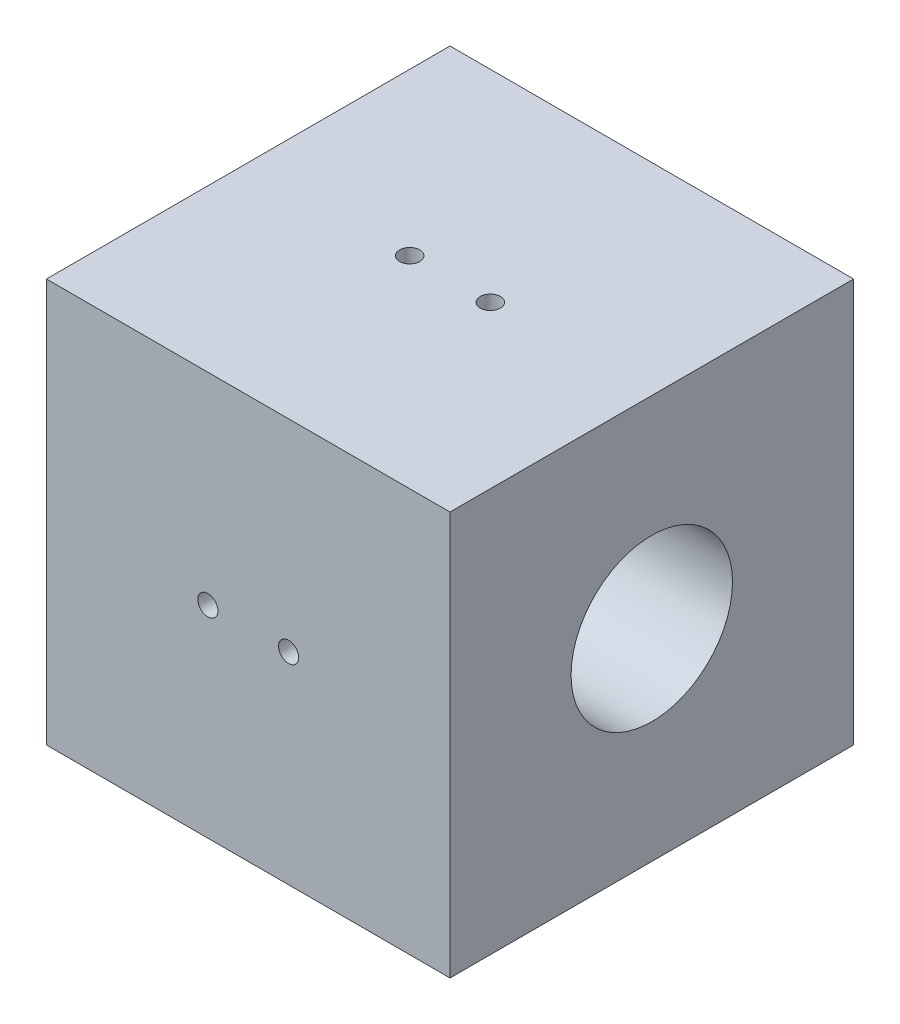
ISO-10303-21;
HEADER;
FILE_DESCRIPTION(('STEP AP214'),'2;1');
FILE_NAME('part.step','',(''),(''),'','','');
FILE_SCHEMA(('AUTOMOTIVE_DESIGN { 1 0 10303 214 1 1 1 1 }'));
ENDSEC;
DATA;
#1=APPLICATION_CONTEXT('core data for automotive mechanical design processes');
#2=APPLICATION_PROTOCOL_DEFINITION('international standard','automotive_design',2000,#1);
#3=PRODUCT_CONTEXT('',#1,'mechanical');
#4=PRODUCT('Part','Part','',(#3));
#5=PRODUCT_RELATED_PRODUCT_CATEGORY('part','',(#4));
#6=PRODUCT_DEFINITION_FORMATION('','',#4);
#7=PRODUCT_DEFINITION_CONTEXT('part definition',#1,'design');
#8=PRODUCT_DEFINITION('design','',#6,#7);
#9=PRODUCT_DEFINITION_SHAPE('','',#8);
#10=(LENGTH_UNIT() NAMED_UNIT(*) SI_UNIT(.MILLI.,.METRE.));
#11=(NAMED_UNIT(*) PLANE_ANGLE_UNIT() SI_UNIT($,.RADIAN.));
#12=(NAMED_UNIT(*) SI_UNIT($,.STERADIAN.) SOLID_ANGLE_UNIT());
#13=UNCERTAINTY_MEASURE_WITH_UNIT(LENGTH_MEASURE(1.E-05),#10,'distance_accuracy_value','');
#14=(GEOMETRIC_REPRESENTATION_CONTEXT(3) GLOBAL_UNCERTAINTY_ASSIGNED_CONTEXT((#13)) GLOBAL_UNIT_ASSIGNED_CONTEXT((#10,
#11,#12)) REPRESENTATION_CONTEXT('',''));
#15=CARTESIAN_POINT('',(0.,0.,0.));
#16=DIRECTION('',(0.,0.,1.));
#17=DIRECTION('',(1.,0.,0.));
#18=AXIS2_PLACEMENT_3D('',#15,#16,#17);
#19=CARTESIAN_POINT('',(63.5,-63.5,127.));
#20=DIRECTION('',(-1.,0.,0.));
#21=DIRECTION('',(0.,0.,1.));
#22=AXIS2_PLACEMENT_3D('',#19,#20,#21);
#23=PLANE('',#22);
#24=CARTESIAN_POINT('',(63.5,0.,63.5));
#25=DIRECTION('',(-1.,0.,0.));
#26=DIRECTION('',(0.,0.,1.));
#27=AXIS2_PLACEMENT_3D('',#24,#25,#26);
#28=CIRCLE('',#27,25.4);
#29=CARTESIAN_POINT('',(63.5,0.,88.9));
#30=VERTEX_POINT('',#29);
#31=EDGE_CURVE('E163',#30,#30,#28,.T.);
#32=ORIENTED_EDGE('',*,*,#31,.T.);
#33=EDGE_LOOP('',(#32));
#34=FACE_BOUND('',#33,.T.);
#35=DIRECTION('',(0.,1.,0.));
#36=VECTOR('',#35,1.);
#37=CARTESIAN_POINT('',(63.5,-63.5,0.));
#38=LINE('',#37,#36);
#39=CARTESIAN_POINT('',(63.5,-63.5,0.));
#40=VERTEX_POINT('',#39);
#41=CARTESIAN_POINT('',(63.5,63.5,0.));
#42=VERTEX_POINT('',#41);
#43=EDGE_CURVE('E116',#40,#42,#38,.T.);
#44=ORIENTED_EDGE('',*,*,#43,.T.);
#45=DIRECTION('',(0.,0.,-1.));
#46=VECTOR('',#45,1.);
#47=CARTESIAN_POINT('',(63.5,63.5,127.));
#48=LINE('',#47,#46);
#49=CARTESIAN_POINT('',(63.5,63.5,127.));
#50=VERTEX_POINT('',#49);
#51=EDGE_CURVE('E13',#50,#42,#48,.T.);
#52=ORIENTED_EDGE('',*,*,#51,.F.);
#53=DIRECTION('',(0.,1.,0.));
#54=VECTOR('',#53,1.);
#55=CARTESIAN_POINT('',(63.5,-63.5,127.));
#56=LINE('',#55,#54);
#57=CARTESIAN_POINT('',(63.5,-63.5,127.));
#58=VERTEX_POINT('',#57);
#59=EDGE_CURVE('E103',#58,#50,#56,.T.);
#60=ORIENTED_EDGE('',*,*,#59,.F.);
#61=DIRECTION('',(0.,0.,-1.));
#62=VECTOR('',#61,1.);
#63=CARTESIAN_POINT('',(63.5,-63.5,127.));
#64=LINE('',#63,#62);
#65=EDGE_CURVE('E112',#58,#40,#64,.T.);
#66=ORIENTED_EDGE('',*,*,#65,.T.);
#67=EDGE_LOOP('',(#44,#52,#60,#66));
#68=FACE_BOUND('',#67,.T.);
#69=ADVANCED_FACE('F46',(#34,#68),#23,.F.);
#70=CARTESIAN_POINT('',(-63.5,63.5,127.));
#71=DIRECTION('',(0.,-1.,0.));
#72=DIRECTION('',(0.,0.,-1.));
#73=AXIS2_PLACEMENT_3D('',#70,#71,#72);
#74=PLANE('',#73);
#75=CARTESIAN_POINT('',(-12.7,63.5,63.5));
#76=DIRECTION('',(0.,-1.,0.));
#77=DIRECTION('',(0.,0.,-1.));
#78=AXIS2_PLACEMENT_3D('',#75,#76,#77);
#79=CIRCLE('',#78,3.175);
#80=CARTESIAN_POINT('',(-12.7,63.5,60.325));
#81=VERTEX_POINT('',#80);
#82=EDGE_CURVE('E119',#81,#81,#79,.T.);
#83=ORIENTED_EDGE('',*,*,#82,.T.);
#84=EDGE_LOOP('',(#83));
#85=FACE_BOUND('',#84,.T.);
#86=CARTESIAN_POINT('',(12.7,63.5,63.5));
#87=DIRECTION('',(0.,-1.,0.));
#88=DIRECTION('',(0.,0.,-1.));
#89=AXIS2_PLACEMENT_3D('',#86,#87,#88);
#90=CIRCLE('',#89,3.175);
#91=CARTESIAN_POINT('',(12.7,63.5,60.325));
#92=VERTEX_POINT('',#91);
#93=EDGE_CURVE('E125',#92,#92,#90,.T.);
#94=ORIENTED_EDGE('',*,*,#93,.T.);
#95=EDGE_LOOP('',(#94));
#96=FACE_BOUND('',#95,.T.);
#97=DIRECTION('',(-1.,0.,0.));
#98=VECTOR('',#97,1.);
#99=CARTESIAN_POINT('',(-63.5,63.5,0.));
#100=LINE('',#99,#98);
#101=CARTESIAN_POINT('',(-63.5,63.5,0.));
#102=VERTEX_POINT('',#101);
#103=EDGE_CURVE('E107',#42,#102,#100,.T.);
#104=ORIENTED_EDGE('',*,*,#103,.T.);
#105=DIRECTION('',(0.,0.,-1.));
#106=VECTOR('',#105,1.);
#107=CARTESIAN_POINT('',(-63.5,63.5,127.));
#108=LINE('',#107,#106);
#109=CARTESIAN_POINT('',(-63.5,63.5,127.));
#110=VERTEX_POINT('',#109);
#111=EDGE_CURVE('E59',#110,#102,#108,.T.);
#112=ORIENTED_EDGE('',*,*,#111,.F.);
#113=DIRECTION('',(-1.,0.,0.));
#114=VECTOR('',#113,1.);
#115=CARTESIAN_POINT('',(-63.5,63.5,127.));
#116=LINE('',#115,#114);
#117=EDGE_CURVE('E98',#50,#110,#116,.T.);
#118=ORIENTED_EDGE('',*,*,#117,.F.);
#119=ORIENTED_EDGE('',*,*,#51,.T.);
#120=EDGE_LOOP('',(#104,#112,#118,#119));
#121=FACE_BOUND('',#120,.T.);
#122=ADVANCED_FACE('F106',(#85,#96,#121),#74,.F.);
#123=CARTESIAN_POINT('',(-63.5,-63.5,127.));
#124=DIRECTION('',(1.,0.,0.));
#125=DIRECTION('',(0.,0.,-1.));
#126=AXIS2_PLACEMENT_3D('',#123,#124,#125);
#127=PLANE('',#126);
#128=CARTESIAN_POINT('',(-63.5,0.,63.5));
#129=DIRECTION('',(-1.,0.,0.));
#130=DIRECTION('',(0.,0.,1.));
#131=AXIS2_PLACEMENT_3D('',#128,#129,#130);
#132=CIRCLE('',#131,25.4);
#133=CARTESIAN_POINT('',(-63.5,0.,88.9));
#134=VERTEX_POINT('',#133);
#135=EDGE_CURVE('E187',#134,#134,#132,.T.);
#136=ORIENTED_EDGE('',*,*,#135,.F.);
#137=EDGE_LOOP('',(#136));
#138=FACE_BOUND('',#137,.T.);
#139=DIRECTION('',(0.,-1.,0.));
#140=VECTOR('',#139,1.);
#141=CARTESIAN_POINT('',(-63.5,-63.5,0.));
#142=LINE('',#141,#140);
#143=CARTESIAN_POINT('',(-63.5,-63.5,0.));
#144=VERTEX_POINT('',#143);
#145=EDGE_CURVE('E85',#102,#144,#142,.T.);
#146=ORIENTED_EDGE('',*,*,#145,.T.);
#147=DIRECTION('',(0.,0.,-1.));
#148=VECTOR('',#147,1.);
#149=CARTESIAN_POINT('',(-63.5,-63.5,127.));
#150=LINE('',#149,#148);
#151=CARTESIAN_POINT('',(-63.5,-63.5,127.));
#152=VERTEX_POINT('',#151);
#153=EDGE_CURVE('E108',#152,#144,#150,.T.);
#154=ORIENTED_EDGE('',*,*,#153,.F.);
#155=DIRECTION('',(0.,-1.,0.));
#156=VECTOR('',#155,1.);
#157=CARTESIAN_POINT('',(-63.5,-63.5,127.));
#158=LINE('',#157,#156);
#159=EDGE_CURVE('E101',#110,#152,#158,.T.);
#160=ORIENTED_EDGE('',*,*,#159,.F.);
#161=ORIENTED_EDGE('',*,*,#111,.T.);
#162=EDGE_LOOP('',(#146,#154,#160,#161));
#163=FACE_BOUND('',#162,.T.);
#164=ADVANCED_FACE('F110',(#138,#163),#127,.F.);
#165=CARTESIAN_POINT('',(-63.5,-63.5,127.));
#166=DIRECTION('',(0.,1.,0.));
#167=DIRECTION('',(0.,0.,1.));
#168=AXIS2_PLACEMENT_3D('',#165,#166,#167);
#169=PLANE('',#168);
#170=DIRECTION('',(1.,0.,0.));
#171=VECTOR('',#170,1.);
#172=CARTESIAN_POINT('',(-63.5,-63.5,0.));
#173=LINE('',#172,#171);
#174=EDGE_CURVE('E91',#144,#40,#173,.T.);
#175=ORIENTED_EDGE('',*,*,#174,.T.);
#176=ORIENTED_EDGE('',*,*,#65,.F.);
#177=DIRECTION('',(1.,0.,0.));
#178=VECTOR('',#177,1.);
#179=CARTESIAN_POINT('',(-63.5,-63.5,127.));
#180=LINE('',#179,#178);
#181=EDGE_CURVE('E68',#152,#58,#180,.T.);
#182=ORIENTED_EDGE('',*,*,#181,.F.);
#183=ORIENTED_EDGE('',*,*,#153,.T.);
#184=EDGE_LOOP('',(#175,#176,#182,#183));
#185=FACE_BOUND('',#184,.T.);
#186=ADVANCED_FACE('F176',(#185),#169,.F.);
#187=CARTESIAN_POINT('',(0.,0.,127.));
#188=DIRECTION('',(0.,0.,-1.));
#189=DIRECTION('',(-1.,0.,0.));
#190=AXIS2_PLACEMENT_3D('',#187,#188,#189);
#191=PLANE('',#190);
#192=CARTESIAN_POINT('',(-12.7,0.,127.));
#193=DIRECTION('',(0.,0.,-1.));
#194=DIRECTION('',(-1.,0.,0.));
#195=AXIS2_PLACEMENT_3D('',#192,#193,#194);
#196=CIRCLE('',#195,3.175);
#197=CARTESIAN_POINT('',(-15.875,0.,127.));
#198=VERTEX_POINT('',#197);
#199=EDGE_CURVE('E128',#198,#198,#196,.T.);
#200=ORIENTED_EDGE('',*,*,#199,.T.);
#201=EDGE_LOOP('',(#200));
#202=FACE_BOUND('',#201,.T.);
#203=CARTESIAN_POINT('',(12.7,0.,127.));
#204=DIRECTION('',(0.,0.,-1.));
#205=DIRECTION('',(-1.,0.,0.));
#206=AXIS2_PLACEMENT_3D('',#203,#204,#205);
#207=CIRCLE('',#206,3.175);
#208=CARTESIAN_POINT('',(9.525,0.,127.));
#209=VERTEX_POINT('',#208);
#210=EDGE_CURVE('E131',#209,#209,#207,.T.);
#211=ORIENTED_EDGE('',*,*,#210,.T.);
#212=EDGE_LOOP('',(#211));
#213=FACE_BOUND('',#212,.T.);
#214=ORIENTED_EDGE('',*,*,#59,.T.);
#215=ORIENTED_EDGE('',*,*,#117,.T.);
#216=ORIENTED_EDGE('',*,*,#159,.T.);
#217=ORIENTED_EDGE('',*,*,#181,.T.);
#218=EDGE_LOOP('',(#214,#215,#216,#217));
#219=FACE_BOUND('',#218,.T.);
#220=ADVANCED_FACE('F99',(#202,#213,#219),#191,.F.);
#221=CARTESIAN_POINT('',(0.,0.,0.));
#222=DIRECTION('',(0.,0.,-1.));
#223=DIRECTION('',(-1.,0.,0.));
#224=AXIS2_PLACEMENT_3D('',#221,#222,#223);
#225=PLANE('',#224);
#226=ORIENTED_EDGE('',*,*,#43,.F.);
#227=ORIENTED_EDGE('',*,*,#174,.F.);
#228=ORIENTED_EDGE('',*,*,#145,.F.);
#229=ORIENTED_EDGE('',*,*,#103,.F.);
#230=EDGE_LOOP('',(#226,#227,#228,#229));
#231=FACE_BOUND('',#230,.T.);
#232=ADVANCED_FACE('F166',(#231),#225,.T.);
#233=CARTESIAN_POINT('',(12.7,15.5,63.5));
#234=DIRECTION('',(0.,1.,0.));
#235=DIRECTION('',(0.,0.,1.));
#236=AXIS2_PLACEMENT_3D('',#233,#234,#235);
#237=CYLINDRICAL_SURFACE('',#236,3.175);
#238=CARTESIAN_POINT('',(12.7,25.2007812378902,66.675));
#239=CARTESIAN_POINT('',(12.5224079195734,25.2007837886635,66.6749924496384));
#240=CARTESIAN_POINT('',(12.3447048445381,25.2026787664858,66.6600494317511));
#241=CARTESIAN_POINT('',(11.9942442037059,25.2100510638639,66.6006750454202));
#242=CARTESIAN_POINT('',(11.8214920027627,25.2155321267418,66.5562128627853));
#243=CARTESIAN_POINT('',(11.4860579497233,25.2294462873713,66.4391313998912));
#244=CARTESIAN_POINT('',(11.3233693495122,25.2378773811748,66.3665312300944));
#245=CARTESIAN_POINT('',(11.0125148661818,25.2567392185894,66.1952755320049));
#246=CARTESIAN_POINT('',(10.8643465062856,25.2671696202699,66.0966244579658));
#247=CARTESIAN_POINT('',(10.5858789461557,25.2889202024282,65.875475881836));
#248=CARTESIAN_POINT('',(10.4556727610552,25.3002445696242,65.7528616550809));
#249=CARTESIAN_POINT('',(10.2176290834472,25.3224694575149,65.4875185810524));
#250=CARTESIAN_POINT('',(10.1097927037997,25.333369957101,65.3447887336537));
#251=CARTESIAN_POINT('',(9.91921615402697,25.3535617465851,65.0426814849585));
#252=CARTESIAN_POINT('',(9.83656015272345,25.362847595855,64.8832505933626));
#253=CARTESIAN_POINT('',(9.69922977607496,25.3787178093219,64.552635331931));
#254=CARTESIAN_POINT('',(9.64455436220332,25.3853022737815,64.3814513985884));
#255=CARTESIAN_POINT('',(9.56501507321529,25.3949983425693,64.0331405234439));
#256=CARTESIAN_POINT('',(9.53999656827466,25.3981279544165,63.8560494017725));
#257=CARTESIAN_POINT('',(9.5200020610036,25.400623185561,63.5001564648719));
#258=CARTESIAN_POINT('',(9.52502487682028,25.3999889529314,63.3213547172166));
#259=CARTESIAN_POINT('',(9.56484650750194,25.3950425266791,62.9681681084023));
#260=CARTESIAN_POINT('',(9.59947902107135,25.3907508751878,62.7937641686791));
#261=CARTESIAN_POINT('',(9.69727699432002,25.3789949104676,62.4532632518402));
#262=CARTESIAN_POINT('',(9.76044299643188,25.3715305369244,62.2871664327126));
#263=CARTESIAN_POINT('',(9.91369174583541,25.3542324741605,61.9674798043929));
#264=CARTESIAN_POINT('',(10.0038464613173,25.3443924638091,61.8139248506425));
#265=CARTESIAN_POINT('',(10.2084611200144,25.3234440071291,61.5240610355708));
#266=CARTESIAN_POINT('',(10.3229221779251,25.3123355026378,61.387752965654));
#267=CARTESIAN_POINT('',(10.57383180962,25.2900036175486,61.1352752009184));
#268=CARTESIAN_POINT('',(10.7104253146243,25.27877997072,61.0192495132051));
#269=CARTESIAN_POINT('',(11.0012245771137,25.2575577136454,60.8117492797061));
#270=CARTESIAN_POINT('',(11.1554303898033,25.2475591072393,60.7202748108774));
#271=CARTESIAN_POINT('',(11.4772052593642,25.2299190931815,60.5644653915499));
#272=CARTESIAN_POINT('',(11.6447799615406,25.2222786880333,60.5001419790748));
#273=CARTESIAN_POINT('',(11.9884691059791,25.2102396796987,60.4005882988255));
#274=CARTESIAN_POINT('',(12.1645831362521,25.2058409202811,60.3653566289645));
#275=CARTESIAN_POINT('',(12.5190798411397,25.2008117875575,60.3251772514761));
#276=CARTESIAN_POINT('',(12.6974392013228,25.2001561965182,60.3200268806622));
#277=CARTESIAN_POINT('',(13.0524782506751,25.2026209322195,60.3396215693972));
#278=CARTESIAN_POINT('',(13.2291579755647,25.2057411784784,60.3643659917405));
#279=CARTESIAN_POINT('',(13.5752151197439,25.2153830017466,60.4428772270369));
#280=CARTESIAN_POINT('',(13.7446151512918,25.2218930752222,60.4965459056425));
#281=CARTESIAN_POINT('',(14.0720116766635,25.2375716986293,60.6312811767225));
#282=CARTESIAN_POINT('',(14.2300077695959,25.2467403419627,60.7123487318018));
#283=CARTESIAN_POINT('',(14.5310283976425,25.2667634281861,60.9000788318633));
#284=CARTESIAN_POINT('',(14.6739694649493,25.2776265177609,61.0068742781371));
#285=CARTESIAN_POINT('',(14.9399708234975,25.299787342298,61.2428407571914));
#286=CARTESIAN_POINT('',(15.0630303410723,25.3110850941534,61.3720126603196));
#287=CARTESIAN_POINT('',(15.2864873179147,25.3329197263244,61.6499506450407));
#288=CARTESIAN_POINT('',(15.3867516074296,25.343451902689,61.7988242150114));
#289=CARTESIAN_POINT('',(15.5608505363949,25.3624983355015,62.1114168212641));
#290=CARTESIAN_POINT('',(15.6346857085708,25.371012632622,62.2751355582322));
#291=CARTESIAN_POINT('',(15.7536105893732,25.3850430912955,62.6123285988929));
#292=CARTESIAN_POINT('',(15.7987772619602,25.3905672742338,62.7857754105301));
#293=CARTESIAN_POINT('',(15.859333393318,25.3980283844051,63.137864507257));
#294=CARTESIAN_POINT('',(15.874724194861,25.3999654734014,63.3165065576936));
#295=CARTESIAN_POINT('',(15.875266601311,25.4000333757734,63.6726148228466));
#296=CARTESIAN_POINT('',(15.8606235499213,25.3981900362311,63.8500807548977));
#297=CARTESIAN_POINT('',(15.8019488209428,25.3909555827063,64.2000084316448));
#298=CARTESIAN_POINT('',(15.757917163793,25.3855644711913,64.3724701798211));
#299=CARTESIAN_POINT('',(15.641779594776,25.371837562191,64.7074670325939));
#300=CARTESIAN_POINT('',(15.5696835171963,25.363502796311,64.8700055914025));
#301=CARTESIAN_POINT('',(15.3994849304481,25.3448114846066,65.180709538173));
#302=CARTESIAN_POINT('',(15.3013821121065,25.3344549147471,65.3288747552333));
#303=CARTESIAN_POINT('',(15.0811951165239,25.3127915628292,65.6076751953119));
#304=CARTESIAN_POINT('',(14.9589581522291,25.3014790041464,65.7381893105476));
#305=CARTESIAN_POINT('',(14.6942899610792,25.2792250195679,65.9769332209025));
#306=CARTESIAN_POINT('',(14.551853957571,25.2682836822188,66.085157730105));
#307=CARTESIAN_POINT('',(14.2502001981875,25.2479659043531,66.2766076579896));
#308=CARTESIAN_POINT('',(14.0909197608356,25.2385956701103,66.3597349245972));
#309=CARTESIAN_POINT('',(13.7606319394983,25.2225537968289,66.4979433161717));
#310=CARTESIAN_POINT('',(13.5896375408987,25.2158792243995,66.5530549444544));
#311=CARTESIAN_POINT('',(13.2981319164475,25.2076049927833,66.6204736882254));
#312=CARTESIAN_POINT('',(13.1794593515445,25.2050588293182,66.6408916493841));
#313=CARTESIAN_POINT('',(12.9405414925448,25.20164609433,66.6681573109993));
#314=CARTESIAN_POINT('',(12.8202962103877,25.2007795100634,66.6750051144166));
#315=CARTESIAN_POINT('',(12.7,25.2007812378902,66.675));
#316=B_SPLINE_CURVE_WITH_KNOTS('',3,(#238,#239,#240,#241,#242,#243,#244,#245,#246,#247,#248,
#249,#250,#251,#252,#253,#254,#255,#256,#257,#258,#259,#260,#261,#262,#263,#264,#265,#266,#267,
#268,#269,#270,#271,#272,#273,#274,#275,#276,#277,#278,#279,#280,#281,#282,#283,#284,#285,#286,
#287,#288,#289,#290,#291,#292,#293,#294,#295,#296,#297,#298,#299,#300,#301,#302,#303,#304,#305,
#306,#307,#308,#309,#310,#311,#312,#313,#314,#315),.UNSPECIFIED.,.T.,.F.,(4,2,2,2,2,2,2,2,2,2,2,
2,2,2,2,2,2,2,2,2,2,2,2,2,2,2,2,2,2,2,2,2,2,2,2,2,2,2,4),(0.,0.532336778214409,1.06523012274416,
1.59776217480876,2.13020323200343,2.66530553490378,3.20043445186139,3.73733296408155,
4.27421154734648,4.80827838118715,5.34232420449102,5.87339014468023,6.40446618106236,
6.93697119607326,7.46950063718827,8.00566975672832,8.54184055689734,9.07823897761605,
9.61461154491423,10.1473662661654,10.680109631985,11.2110567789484,11.7420225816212,
12.2757923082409,12.8095828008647,13.3464158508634,13.8832380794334,14.4186129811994,
14.9539637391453,15.4856664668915,16.0173688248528,16.5488850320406,17.0804075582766,
17.6154096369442,18.1505384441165,18.6877337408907,19.2243428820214,19.5849365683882,
19.9455275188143),.UNSPECIFIED.);
#317=CARTESIAN_POINT('',(12.7,25.2007812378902,66.675));
#318=VERTEX_POINT('',#317);
#319=EDGE_CURVE('E133',#318,#318,#316,.T.);
#320=ORIENTED_EDGE('',*,*,#319,.T.);
#321=EDGE_LOOP('',(#320));
#322=FACE_BOUND('',#321,.T.);
#323=ORIENTED_EDGE('',*,*,#93,.F.);
#324=EDGE_LOOP('',(#323));
#325=FACE_BOUND('',#324,.T.);
#326=ADVANCED_FACE('F168',(#322,#325),#237,.F.);
#327=CARTESIAN_POINT('',(-12.7,15.5,63.5));
#328=DIRECTION('',(0.,1.,0.));
#329=DIRECTION('',(0.,0.,1.));
#330=AXIS2_PLACEMENT_3D('',#327,#328,#329);
#331=CYLINDRICAL_SURFACE('',#330,3.175);
#332=CARTESIAN_POINT('',(-12.7,25.2007812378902,66.675));
#333=CARTESIAN_POINT('',(-12.8775920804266,25.2007837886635,66.6749924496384));
#334=CARTESIAN_POINT('',(-13.0552951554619,25.2026787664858,66.6600494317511));
#335=CARTESIAN_POINT('',(-13.4057557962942,25.2100510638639,66.6006750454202));
#336=CARTESIAN_POINT('',(-13.5785079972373,25.2155321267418,66.5562128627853));
#337=CARTESIAN_POINT('',(-13.9139420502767,25.2294462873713,66.4391313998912));
#338=CARTESIAN_POINT('',(-14.0766306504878,25.2378773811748,66.3665312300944));
#339=CARTESIAN_POINT('',(-14.3874851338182,25.2567392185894,66.1952755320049));
#340=CARTESIAN_POINT('',(-14.5356534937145,25.2671696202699,66.0966244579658));
#341=CARTESIAN_POINT('',(-14.8141210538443,25.2889202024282,65.875475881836));
#342=CARTESIAN_POINT('',(-14.9443272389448,25.3002445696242,65.7528616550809));
#343=CARTESIAN_POINT('',(-15.1823709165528,25.3224694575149,65.4875185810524));
#344=CARTESIAN_POINT('',(-15.2902072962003,25.333369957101,65.3447887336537));
#345=CARTESIAN_POINT('',(-15.480783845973,25.3535617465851,65.0426814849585));
#346=CARTESIAN_POINT('',(-15.5634398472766,25.362847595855,64.8832505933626));
#347=CARTESIAN_POINT('',(-15.700770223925,25.3787178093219,64.552635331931));
#348=CARTESIAN_POINT('',(-15.7554456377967,25.3853022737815,64.3814513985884));
#349=CARTESIAN_POINT('',(-15.8349849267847,25.3949983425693,64.0331405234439));
#350=CARTESIAN_POINT('',(-15.8600034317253,25.3981279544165,63.8560494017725));
#351=CARTESIAN_POINT('',(-15.8799979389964,25.400623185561,63.5001564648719));
#352=CARTESIAN_POINT('',(-15.8749751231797,25.3999889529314,63.3213547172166));
#353=CARTESIAN_POINT('',(-15.8351534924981,25.3950425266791,62.9681681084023));
#354=CARTESIAN_POINT('',(-15.8005209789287,25.3907508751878,62.7937641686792));
#355=CARTESIAN_POINT('',(-15.70272300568,25.3789949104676,62.4532632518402));
#356=CARTESIAN_POINT('',(-15.6395570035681,25.3715305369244,62.2871664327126));
#357=CARTESIAN_POINT('',(-15.4863082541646,25.3542324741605,61.9674798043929));
#358=CARTESIAN_POINT('',(-15.3961535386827,25.3443924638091,61.8139248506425));
#359=CARTESIAN_POINT('',(-15.1915388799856,25.3234440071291,61.5240610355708));
#360=CARTESIAN_POINT('',(-15.0770778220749,25.3123355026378,61.387752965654));
#361=CARTESIAN_POINT('',(-14.8261681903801,25.2900036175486,61.1352752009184));
#362=CARTESIAN_POINT('',(-14.6895746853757,25.27877997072,61.0192495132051));
#363=CARTESIAN_POINT('',(-14.3987754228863,25.2575577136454,60.8117492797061));
#364=CARTESIAN_POINT('',(-14.2445696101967,25.2475591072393,60.7202748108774));
#365=CARTESIAN_POINT('',(-13.9227947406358,25.2299190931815,60.5644653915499));
#366=CARTESIAN_POINT('',(-13.7552200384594,25.2222786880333,60.5001419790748));
#367=CARTESIAN_POINT('',(-13.4115308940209,25.2102396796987,60.4005882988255));
#368=CARTESIAN_POINT('',(-13.2354168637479,25.2058409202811,60.3653566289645));
#369=CARTESIAN_POINT('',(-12.8809201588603,25.2008117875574,60.3251772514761));
#370=CARTESIAN_POINT('',(-12.7025607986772,25.2001561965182,60.3200268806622));
#371=CARTESIAN_POINT('',(-12.3475217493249,25.2026209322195,60.3396215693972));
#372=CARTESIAN_POINT('',(-12.1708420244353,25.2057411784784,60.3643659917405));
#373=CARTESIAN_POINT('',(-11.8247848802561,25.2153830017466,60.4428772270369));
#374=CARTESIAN_POINT('',(-11.6553848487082,25.2218930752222,60.4965459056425));
#375=CARTESIAN_POINT('',(-11.3279883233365,25.2375716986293,60.6312811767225));
#376=CARTESIAN_POINT('',(-11.1699922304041,25.2467403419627,60.7123487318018));
#377=CARTESIAN_POINT('',(-10.8689716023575,25.2667634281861,60.9000788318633));
#378=CARTESIAN_POINT('',(-10.7260305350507,25.277626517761,61.0068742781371));
#379=CARTESIAN_POINT('',(-10.4600291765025,25.299787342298,61.2428407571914));
#380=CARTESIAN_POINT('',(-10.3369696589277,25.3110850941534,61.3720126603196));
#381=CARTESIAN_POINT('',(-10.1135126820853,25.3329197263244,61.6499506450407));
#382=CARTESIAN_POINT('',(-10.0132483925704,25.343451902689,61.7988242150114));
#383=CARTESIAN_POINT('',(-9.83914946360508,25.3624983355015,62.1114168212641));
#384=CARTESIAN_POINT('',(-9.76531429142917,25.371012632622,62.2751355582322));
#385=CARTESIAN_POINT('',(-9.6463894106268,25.3850430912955,62.6123285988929));
#386=CARTESIAN_POINT('',(-9.60122273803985,25.3905672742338,62.78577541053));
#387=CARTESIAN_POINT('',(-9.54066660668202,25.3980283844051,63.137864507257));
#388=CARTESIAN_POINT('',(-9.52527580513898,25.3999654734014,63.3165065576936));
#389=CARTESIAN_POINT('',(-9.52473339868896,25.4000333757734,63.6726148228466));
#390=CARTESIAN_POINT('',(-9.53937645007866,25.3981900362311,63.8500807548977));
#391=CARTESIAN_POINT('',(-9.59805117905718,25.3909555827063,64.2000084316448));
#392=CARTESIAN_POINT('',(-9.64208283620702,25.3855644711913,64.3724701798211));
#393=CARTESIAN_POINT('',(-9.75822040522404,25.371837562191,64.7074670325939));
#394=CARTESIAN_POINT('',(-9.8303164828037,25.363502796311,64.8700055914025));
#395=CARTESIAN_POINT('',(-10.0005150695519,25.3448114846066,65.180709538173));
#396=CARTESIAN_POINT('',(-10.0986178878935,25.3344549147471,65.3288747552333));
#397=CARTESIAN_POINT('',(-10.3188048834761,25.3127915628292,65.6076751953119));
#398=CARTESIAN_POINT('',(-10.4410418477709,25.3014790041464,65.7381893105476));
#399=CARTESIAN_POINT('',(-10.7057100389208,25.2792250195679,65.9769332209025));
#400=CARTESIAN_POINT('',(-10.848146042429,25.2682836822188,66.085157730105));
#401=CARTESIAN_POINT('',(-11.1497998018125,25.2479659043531,66.2766076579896));
#402=CARTESIAN_POINT('',(-11.3090802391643,25.2385956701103,66.3597349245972));
#403=CARTESIAN_POINT('',(-11.6393680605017,25.2225537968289,66.4979433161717));
#404=CARTESIAN_POINT('',(-11.8103624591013,25.2158792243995,66.5530549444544));
#405=CARTESIAN_POINT('',(-12.1018680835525,25.2076049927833,66.6204736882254));
#406=CARTESIAN_POINT('',(-12.2205406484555,25.2050588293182,66.6408916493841));
#407=CARTESIAN_POINT('',(-12.4594585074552,25.20164609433,66.6681573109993));
#408=CARTESIAN_POINT('',(-12.5797037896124,25.2007795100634,66.6750051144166));
#409=CARTESIAN_POINT('',(-12.7,25.2007812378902,66.675));
#410=B_SPLINE_CURVE_WITH_KNOTS('',3,(#332,#333,#334,#335,#336,#337,#338,#339,#340,#341,#342,
#343,#344,#345,#346,#347,#348,#349,#350,#351,#352,#353,#354,#355,#356,#357,#358,#359,#360,#361,
#362,#363,#364,#365,#366,#367,#368,#369,#370,#371,#372,#373,#374,#375,#376,#377,#378,#379,#380,
#381,#382,#383,#384,#385,#386,#387,#388,#389,#390,#391,#392,#393,#394,#395,#396,#397,#398,#399,
#400,#401,#402,#403,#404,#405,#406,#407,#408,#409),.UNSPECIFIED.,.T.,.F.,(4,2,2,2,2,2,2,2,2,2,2,
2,2,2,2,2,2,2,2,2,2,2,2,2,2,2,2,2,2,2,2,2,2,2,2,2,2,2,4),(0.,0.532336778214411,1.06523012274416,
1.59776217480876,2.13020323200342,2.66530553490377,3.20043445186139,3.73733296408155,
4.27421154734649,4.80827838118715,5.34232420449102,5.87339014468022,6.40446618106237,
6.93697119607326,7.46950063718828,8.00566975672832,8.54184055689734,9.07823897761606,
9.61461154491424,10.1473662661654,10.680109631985,11.2110567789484,11.7420225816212,
12.2757923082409,12.8095828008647,13.3464158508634,13.8832380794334,14.4186129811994,
14.9539637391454,15.4856664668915,16.0173688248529,16.5488850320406,17.0804075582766,
17.6154096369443,18.1505384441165,18.6877337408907,19.2243428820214,19.5849365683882,
19.9455275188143),.UNSPECIFIED.);
#411=CARTESIAN_POINT('',(-12.7,25.2007812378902,66.675));
#412=VERTEX_POINT('',#411);
#413=EDGE_CURVE('E197',#412,#412,#410,.T.);
#414=ORIENTED_EDGE('',*,*,#413,.T.);
#415=EDGE_LOOP('',(#414));
#416=FACE_BOUND('',#415,.T.);
#417=ORIENTED_EDGE('',*,*,#82,.F.);
#418=EDGE_LOOP('',(#417));
#419=FACE_BOUND('',#418,.T.);
#420=ADVANCED_FACE('F149',(#416,#419),#331,.F.);
#421=CARTESIAN_POINT('',(12.7,0.,79.));
#422=DIRECTION('',(0.,0.,1.));
#423=DIRECTION('',(1.,0.,0.));
#424=AXIS2_PLACEMENT_3D('',#421,#422,#423);
#425=CYLINDRICAL_SURFACE('',#424,3.175);
#426=CARTESIAN_POINT('',(15.875,0.,88.9));
#427=CARTESIAN_POINT('',(15.8749924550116,-0.177598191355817,88.8999975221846));
#428=CARTESIAN_POINT('',(15.860048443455,-0.355307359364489,88.8981176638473));
#429=CARTESIAN_POINT('',(15.8006697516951,-0.705780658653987,88.8907993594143));
#430=CARTESIAN_POINT('',(15.7562042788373,-0.878539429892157,88.8853571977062));
#431=CARTESIAN_POINT('',(15.6391131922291,-1.21398738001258,88.871527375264));
#432=CARTESIAN_POINT('',(15.5665065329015,-1.3766832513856,88.8631416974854));
#433=CARTESIAN_POINT('',(15.3952355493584,-1.68754993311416,88.8443575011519));
#434=CARTESIAN_POINT('',(15.296575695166,-1.83572322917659,88.8339593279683));
#435=CARTESIAN_POINT('',(15.0754182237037,-2.11418527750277,88.8122470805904));
#436=CARTESIAN_POINT('',(14.9528058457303,-2.24438256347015,88.8009287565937));
#437=CARTESIAN_POINT('',(14.6874702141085,-2.48240904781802,88.7786861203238));
#438=CARTESIAN_POINT('',(14.5447459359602,-2.59023710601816,88.7677618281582));
#439=CARTESIAN_POINT('',(14.2426436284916,-2.7808049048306,88.7475022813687));
#440=CARTESIAN_POINT('',(14.0832111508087,-2.86345896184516,88.7381725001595));
#441=CARTESIAN_POINT('',(13.7525924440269,-3.0007853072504,88.7222143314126));
#442=CARTESIAN_POINT('',(13.5814066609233,-3.05545865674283,88.7155858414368));
#443=CARTESIAN_POINT('',(13.2330898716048,-3.13499370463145,88.7058213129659));
#444=CARTESIAN_POINT('',(13.0559946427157,-3.16000982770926,88.7026671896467));
#445=CARTESIAN_POINT('',(12.7000936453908,-3.17999814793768,88.7001531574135));
#446=CARTESIAN_POINT('',(12.5212879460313,-3.17497155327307,88.7007930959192));
#447=CARTESIAN_POINT('',(12.168117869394,-3.13514389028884,88.7057783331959));
#448=CARTESIAN_POINT('',(11.9937339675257,-3.10051292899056,88.7101024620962));
#449=CARTESIAN_POINT('',(11.6532723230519,-3.00272498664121,88.7219358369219));
#450=CARTESIAN_POINT('',(11.4871947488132,-2.93956742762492,88.7294451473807));
#451=CARTESIAN_POINT('',(11.1675316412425,-2.78633626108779,88.7468267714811));
#452=CARTESIAN_POINT('',(11.0139819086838,-2.6961887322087,88.7567055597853));
#453=CARTESIAN_POINT('',(10.7241254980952,-2.49158946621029,88.7777080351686));
#454=CARTESIAN_POINT('',(10.5878196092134,-2.37713661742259,88.7888317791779));
#455=CARTESIAN_POINT('',(10.3353327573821,-2.1262328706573,88.8111648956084));
#456=CARTESIAN_POINT('',(10.2192974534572,-1.98963534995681,88.8223743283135));
#457=CARTESIAN_POINT('',(10.0117797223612,-1.69882460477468,88.8435438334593));
#458=CARTESIAN_POINT('',(9.92029735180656,-1.54461133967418,88.8535039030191));
#459=CARTESIAN_POINT('',(9.76448222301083,-1.22283432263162,88.871058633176));
#460=CARTESIAN_POINT('',(9.70015858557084,-1.0552661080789,88.8786524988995));
#461=CARTESIAN_POINT('',(9.60060247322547,-0.71159108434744,88.8906119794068));
#462=CARTESIAN_POINT('',(9.56536863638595,-0.535484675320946,88.8949777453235));
#463=CARTESIAN_POINT('',(9.5251810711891,-0.180991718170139,88.8999694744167));
#464=CARTESIAN_POINT('',(9.52002668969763,-0.00262825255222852,88.9006202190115));
#465=CARTESIAN_POINT('',(9.53961482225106,0.352419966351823,88.898175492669));
#466=CARTESIAN_POINT('',(9.56435669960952,0.529104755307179,88.8950801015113));
#467=CARTESIAN_POINT('',(9.64286833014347,0.875188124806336,88.88550636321));
#468=CARTESIAN_POINT('',(9.69654240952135,1.04460874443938,88.8790391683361));
#469=CARTESIAN_POINT('',(9.83129536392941,1.37204406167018,88.8634458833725));
#470=CARTESIAN_POINT('',(9.91237516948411,1.53005837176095,88.8543197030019));
#471=CARTESIAN_POINT('',(10.1001234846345,1.83109174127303,88.8343641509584));
#472=CARTESIAN_POINT('',(10.2069217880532,1.97402927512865,88.8235262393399));
#473=CARTESIAN_POINT('',(10.4428918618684,2.24002217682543,88.8013863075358));
#474=CARTESIAN_POINT('',(10.5720645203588,2.36307675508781,88.7900842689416));
#475=CARTESIAN_POINT('',(10.8500004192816,2.58652258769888,88.7682134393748));
#476=CARTESIAN_POINT('',(10.9988709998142,2.68678083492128,88.7576491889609));
#477=CARTESIAN_POINT('',(11.3114559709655,2.86086916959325,88.7385247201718));
#478=CARTESIAN_POINT('',(11.4751700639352,2.93469978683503,88.729964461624));
#479=CARTESIAN_POINT('',(11.8123656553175,3.05362175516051,88.715848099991));
#480=CARTESIAN_POINT('',(11.9858203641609,3.09878809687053,88.7102841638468));
#481=CARTESIAN_POINT('',(12.3379261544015,3.15934089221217,88.7027679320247));
#482=CARTESIAN_POINT('',(12.5165769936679,3.17472873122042,88.7008154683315));
#483=CARTESIAN_POINT('',(12.8726805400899,3.17526230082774,88.7007481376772));
#484=CARTESIAN_POINT('',(13.0501329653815,3.16061699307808,88.7026067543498));
#485=CARTESIAN_POINT('',(13.4000330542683,3.10194249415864,88.7098951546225));
#486=CARTESIAN_POINT('',(13.5724807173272,3.05791329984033,88.7153249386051));
#487=CARTESIAN_POINT('',(13.9074486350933,2.94178618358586,88.7291356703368));
#488=CARTESIAN_POINT('',(14.0699724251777,2.86969832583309,88.7375155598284));
#489=CARTESIAN_POINT('',(14.3806502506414,2.69952076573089,88.7562840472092));
#490=CARTESIAN_POINT('',(14.5288041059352,2.60143073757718,88.7666726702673));
#491=CARTESIAN_POINT('',(14.8076046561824,2.38125804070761,88.7883746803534));
#492=CARTESIAN_POINT('',(14.9381279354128,2.2590196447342,88.7996937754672));
#493=CARTESIAN_POINT('',(15.1768896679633,1.99434478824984,88.8219309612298));
#494=CARTESIAN_POINT('',(15.2851228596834,1.85190357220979,88.8328489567));
#495=CARTESIAN_POINT('',(15.4765824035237,1.55024533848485,88.8530996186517));
#496=CARTESIAN_POINT('',(15.5597120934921,1.39096658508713,88.8624260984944));
#497=CARTESIAN_POINT('',(15.6979254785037,1.06068228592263,88.8783801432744));
#498=CARTESIAN_POINT('',(15.7530396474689,0.8896897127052,88.8850106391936));
#499=CARTESIAN_POINT('',(15.8204653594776,0.598177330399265,88.8932273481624));
#500=CARTESIAN_POINT('',(15.8408864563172,0.47949569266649,88.8957547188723));
#501=CARTESIAN_POINT('',(15.8681562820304,0.240559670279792,88.8991418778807));
#502=CARTESIAN_POINT('',(15.8750051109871,0.120305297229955,88.9000016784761));
#503=CARTESIAN_POINT('',(15.875,0.,88.9));
#504=B_SPLINE_CURVE_WITH_KNOTS('',3,(#426,#427,#428,#429,#430,#431,#432,#433,#434,#435,#436,
#437,#438,#439,#440,#441,#442,#443,#444,#445,#446,#447,#448,#449,#450,#451,#452,#453,#454,#455,
#456,#457,#458,#459,#460,#461,#462,#463,#464,#465,#466,#467,#468,#469,#470,#471,#472,#473,#474,
#475,#476,#477,#478,#479,#480,#481,#482,#483,#484,#485,#486,#487,#488,#489,#490,#491,#492,#493,
#494,#495,#496,#497,#498,#499,#500,#501,#502,#503),.UNSPECIFIED.,.T.,.F.,(4,2,2,2,2,2,2,2,2,2,2,
2,2,2,2,2,2,2,2,2,2,2,2,2,2,2,2,2,2,2,2,2,2,2,2,2,2,2,4),(0.,0.532355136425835,1.06526642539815,
1.59781939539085,2.13028105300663,2.6653593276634,3.20046486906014,3.73737187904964,
4.27425852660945,4.80833716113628,5.34239431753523,5.87340324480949,6.40442293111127,
6.93691051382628,7.46942245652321,8.00561617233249,8.54181112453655,9.07818600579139,
9.61453577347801,10.1473035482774,10.6800599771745,11.2110653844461,11.7420888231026,
12.275850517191,12.8096334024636,13.3464550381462,13.8832659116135,14.4186665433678,
14.9540422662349,15.4857056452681,16.0173690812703,16.5488419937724,17.0803215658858,
17.6153475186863,18.1504996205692,18.6876868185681,19.2242884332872,19.5849093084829,
19.9455275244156),.UNSPECIFIED.);
#505=CARTESIAN_POINT('',(15.875,0.,88.9));
#506=VERTEX_POINT('',#505);
#507=EDGE_CURVE('E192',#506,#506,#504,.T.);
#508=ORIENTED_EDGE('',*,*,#507,.T.);
#509=EDGE_LOOP('',(#508));
#510=FACE_BOUND('',#509,.T.);
#511=ORIENTED_EDGE('',*,*,#210,.F.);
#512=EDGE_LOOP('',(#511));
#513=FACE_BOUND('',#512,.T.);
#514=ADVANCED_FACE('F142',(#510,#513),#425,.F.);
#515=CARTESIAN_POINT('',(-12.7,0.,79.));
#516=DIRECTION('',(0.,0.,1.));
#517=DIRECTION('',(1.,0.,0.));
#518=AXIS2_PLACEMENT_3D('',#515,#516,#517);
#519=CYLINDRICAL_SURFACE('',#518,3.175);
#520=CARTESIAN_POINT('',(-9.525,0.,88.9));
#521=CARTESIAN_POINT('',(-9.52500754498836,-0.177598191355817,88.8999975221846));
#522=CARTESIAN_POINT('',(-9.53995155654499,-0.355307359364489,88.8981176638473));
#523=CARTESIAN_POINT('',(-9.59933024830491,-0.705780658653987,88.8907993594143));
#524=CARTESIAN_POINT('',(-9.64379572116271,-0.878539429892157,88.8853571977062));
#525=CARTESIAN_POINT('',(-9.76088680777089,-1.21398738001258,88.871527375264));
#526=CARTESIAN_POINT('',(-9.83349346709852,-1.3766832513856,88.8631416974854));
#527=CARTESIAN_POINT('',(-10.0047644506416,-1.68754993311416,88.8443575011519));
#528=CARTESIAN_POINT('',(-10.103424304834,-1.83572322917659,88.8339593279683));
#529=CARTESIAN_POINT('',(-10.3245817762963,-2.11418527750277,88.8122470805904));
#530=CARTESIAN_POINT('',(-10.4471941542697,-2.24438256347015,88.8009287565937));
#531=CARTESIAN_POINT('',(-10.7125297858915,-2.48240904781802,88.7786861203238));
#532=CARTESIAN_POINT('',(-10.8552540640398,-2.59023710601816,88.7677618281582));
#533=CARTESIAN_POINT('',(-11.1573563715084,-2.7808049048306,88.7475022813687));
#534=CARTESIAN_POINT('',(-11.3167888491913,-2.86345896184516,88.7381725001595));
#535=CARTESIAN_POINT('',(-11.6474075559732,-3.0007853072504,88.7222143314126));
#536=CARTESIAN_POINT('',(-11.8185933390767,-3.05545865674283,88.7155858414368));
#537=CARTESIAN_POINT('',(-12.1669101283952,-3.13499370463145,88.7058213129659));
#538=CARTESIAN_POINT('',(-12.3440053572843,-3.16000982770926,88.7026671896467));
#539=CARTESIAN_POINT('',(-12.6999063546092,-3.17999814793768,88.7001531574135));
#540=CARTESIAN_POINT('',(-12.8787120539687,-3.17497155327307,88.7007930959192));
#541=CARTESIAN_POINT('',(-13.231882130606,-3.13514389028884,88.7057783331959));
#542=CARTESIAN_POINT('',(-13.4062660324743,-3.10051292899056,88.7101024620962));
#543=CARTESIAN_POINT('',(-13.7467276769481,-3.0027249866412,88.7219358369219));
#544=CARTESIAN_POINT('',(-13.9128052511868,-2.93956742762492,88.7294451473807));
#545=CARTESIAN_POINT('',(-14.2324683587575,-2.78633626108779,88.7468267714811));
#546=CARTESIAN_POINT('',(-14.3860180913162,-2.6961887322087,88.7567055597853));
#547=CARTESIAN_POINT('',(-14.6758745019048,-2.49158946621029,88.7777080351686));
#548=CARTESIAN_POINT('',(-14.8121803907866,-2.37713661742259,88.7888317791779));
#549=CARTESIAN_POINT('',(-15.0646672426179,-2.1262328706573,88.8111648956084));
#550=CARTESIAN_POINT('',(-15.1807025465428,-1.98963534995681,88.8223743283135));
#551=CARTESIAN_POINT('',(-15.3882202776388,-1.69882460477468,88.8435438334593));
#552=CARTESIAN_POINT('',(-15.4797026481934,-1.54461133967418,88.8535039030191));
#553=CARTESIAN_POINT('',(-15.6355177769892,-1.22283432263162,88.871058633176));
#554=CARTESIAN_POINT('',(-15.6998414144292,-1.0552661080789,88.8786524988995));
#555=CARTESIAN_POINT('',(-15.7993975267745,-0.711591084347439,88.8906119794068));
#556=CARTESIAN_POINT('',(-15.8346313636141,-0.535484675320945,88.8949777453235));
#557=CARTESIAN_POINT('',(-15.8748189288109,-0.180991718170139,88.8999694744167));
#558=CARTESIAN_POINT('',(-15.8799733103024,-0.00262825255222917,88.9006202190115));
#559=CARTESIAN_POINT('',(-15.8603851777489,0.352419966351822,88.898175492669));
#560=CARTESIAN_POINT('',(-15.8356433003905,0.529104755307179,88.8950801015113));
#561=CARTESIAN_POINT('',(-15.7571316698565,0.875188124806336,88.88550636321));
#562=CARTESIAN_POINT('',(-15.7034575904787,1.04460874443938,88.8790391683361));
#563=CARTESIAN_POINT('',(-15.5687046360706,1.37204406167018,88.8634458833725));
#564=CARTESIAN_POINT('',(-15.4876248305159,1.53005837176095,88.8543197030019));
#565=CARTESIAN_POINT('',(-15.2998765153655,1.83109174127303,88.8343641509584));
#566=CARTESIAN_POINT('',(-15.1930782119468,1.97402927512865,88.8235262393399));
#567=CARTESIAN_POINT('',(-14.9571081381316,2.24002217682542,88.8013863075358));
#568=CARTESIAN_POINT('',(-14.8279354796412,2.36307675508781,88.7900842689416));
#569=CARTESIAN_POINT('',(-14.5499995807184,2.58652258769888,88.7682134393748));
#570=CARTESIAN_POINT('',(-14.4011290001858,2.68678083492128,88.7576491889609));
#571=CARTESIAN_POINT('',(-14.0885440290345,2.86086916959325,88.7385247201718));
#572=CARTESIAN_POINT('',(-13.9248299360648,2.93469978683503,88.729964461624));
#573=CARTESIAN_POINT('',(-13.5876343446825,3.05362175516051,88.715848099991));
#574=CARTESIAN_POINT('',(-13.4141796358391,3.09878809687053,88.7102841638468));
#575=CARTESIAN_POINT('',(-13.0620738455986,3.15934089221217,88.7027679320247));
#576=CARTESIAN_POINT('',(-12.8834230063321,3.17472873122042,88.7008154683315));
#577=CARTESIAN_POINT('',(-12.5273194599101,3.17526230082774,88.7007481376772));
#578=CARTESIAN_POINT('',(-12.3498670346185,3.16061699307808,88.7026067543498));
#579=CARTESIAN_POINT('',(-11.9999669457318,3.10194249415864,88.7098951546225));
#580=CARTESIAN_POINT('',(-11.8275192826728,3.05791329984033,88.7153249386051));
#581=CARTESIAN_POINT('',(-11.4925513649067,2.94178618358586,88.7291356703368));
#582=CARTESIAN_POINT('',(-11.3300275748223,2.86969832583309,88.7375155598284));
#583=CARTESIAN_POINT('',(-11.0193497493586,2.69952076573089,88.7562840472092));
#584=CARTESIAN_POINT('',(-10.8711958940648,2.60143073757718,88.7666726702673));
#585=CARTESIAN_POINT('',(-10.5923953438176,2.38125804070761,88.7883746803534));
#586=CARTESIAN_POINT('',(-10.4618720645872,2.2590196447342,88.7996937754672));
#587=CARTESIAN_POINT('',(-10.2231103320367,1.99434478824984,88.8219309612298));
#588=CARTESIAN_POINT('',(-10.1148771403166,1.85190357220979,88.8328489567));
#589=CARTESIAN_POINT('',(-9.92341759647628,1.55024533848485,88.8530996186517));
#590=CARTESIAN_POINT('',(-9.84028790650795,1.39096658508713,88.8624260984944));
#591=CARTESIAN_POINT('',(-9.70207452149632,1.06068228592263,88.8783801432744));
#592=CARTESIAN_POINT('',(-9.64696035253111,0.889689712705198,88.8850106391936));
#593=CARTESIAN_POINT('',(-9.57953464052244,0.598177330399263,88.8932273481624));
#594=CARTESIAN_POINT('',(-9.55911354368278,0.479495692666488,88.8957547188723));
#595=CARTESIAN_POINT('',(-9.53184371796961,0.240559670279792,88.8991418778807));
#596=CARTESIAN_POINT('',(-9.52499488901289,0.120305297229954,88.9000016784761));
#597=CARTESIAN_POINT('',(-9.525,0.,88.9));
#598=B_SPLINE_CURVE_WITH_KNOTS('',3,(#520,#521,#522,#523,#524,#525,#526,#527,#528,#529,#530,
#531,#532,#533,#534,#535,#536,#537,#538,#539,#540,#541,#542,#543,#544,#545,#546,#547,#548,#549,
#550,#551,#552,#553,#554,#555,#556,#557,#558,#559,#560,#561,#562,#563,#564,#565,#566,#567,#568,
#569,#570,#571,#572,#573,#574,#575,#576,#577,#578,#579,#580,#581,#582,#583,#584,#585,#586,#587,
#588,#589,#590,#591,#592,#593,#594,#595,#596,#597),.UNSPECIFIED.,.T.,.F.,(4,2,2,2,2,2,2,2,2,2,2,
2,2,2,2,2,2,2,2,2,2,2,2,2,2,2,2,2,2,2,2,2,2,2,2,2,2,2,4),(0.,0.532355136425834,1.06526642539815,
1.59781939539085,2.13028105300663,2.66535932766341,3.20046486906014,3.73737187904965,
4.27425852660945,4.80833716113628,5.34239431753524,5.8734032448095,6.40442293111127,
6.93691051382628,7.46942245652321,8.00561617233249,8.54181112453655,9.07818600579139,
9.61453577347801,10.1473035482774,10.6800599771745,11.2110653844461,11.7420888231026,
12.275850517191,12.8096334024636,13.3464550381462,13.8832659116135,14.4186665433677,
14.9540422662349,15.4857056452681,16.0173690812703,16.5488419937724,17.0803215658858,
17.6153475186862,18.1504996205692,18.687686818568,19.2242884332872,19.5849093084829,
19.9455275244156),.UNSPECIFIED.);
#599=CARTESIAN_POINT('',(-9.525,0.,88.9));
#600=VERTEX_POINT('',#599);
#601=EDGE_CURVE('E49',#600,#600,#598,.T.);
#602=ORIENTED_EDGE('',*,*,#601,.T.);
#603=EDGE_LOOP('',(#602));
#604=FACE_BOUND('',#603,.T.);
#605=ORIENTED_EDGE('',*,*,#199,.F.);
#606=EDGE_LOOP('',(#605));
#607=FACE_BOUND('',#606,.T.);
#608=ADVANCED_FACE('F139',(#604,#607),#519,.F.);
#609=CARTESIAN_POINT('',(63.5,0.,63.5));
#610=DIRECTION('',(-1.,0.,0.));
#611=DIRECTION('',(0.,0.,1.));
#612=AXIS2_PLACEMENT_3D('',#609,#610,#611);
#613=CYLINDRICAL_SURFACE('',#612,25.4);
#614=ORIENTED_EDGE('',*,*,#413,.F.);
#615=EDGE_LOOP('',(#614));
#616=FACE_BOUND('',#615,.T.);
#617=ORIENTED_EDGE('',*,*,#601,.F.);
#618=EDGE_LOOP('',(#617));
#619=FACE_BOUND('',#618,.T.);
#620=ORIENTED_EDGE('',*,*,#31,.F.);
#621=EDGE_LOOP('',(#620));
#622=FACE_BOUND('',#621,.T.);
#623=ORIENTED_EDGE('',*,*,#135,.T.);
#624=EDGE_LOOP('',(#623));
#625=FACE_BOUND('',#624,.T.);
#626=ORIENTED_EDGE('',*,*,#507,.F.);
#627=EDGE_LOOP('',(#626));
#628=FACE_BOUND('',#627,.T.);
#629=ORIENTED_EDGE('',*,*,#319,.F.);
#630=EDGE_LOOP('',(#629));
#631=FACE_BOUND('',#630,.T.);
#632=ADVANCED_FACE('F141',(#616,#619,#622,#625,#628,#631),#613,.F.);
#633=CLOSED_SHELL('',(#69,#122,#164,#186,#220,#232,#326,#420,#514,#608,#632));
#634=MANIFOLD_SOLID_BREP('B2',#633);
#635=ADVANCED_BREP_SHAPE_REPRESENTATION('',(#18,#634),#14);
#636=SHAPE_DEFINITION_REPRESENTATION(#9,#635);
ENDSEC;
END-ISO-10303-21;
